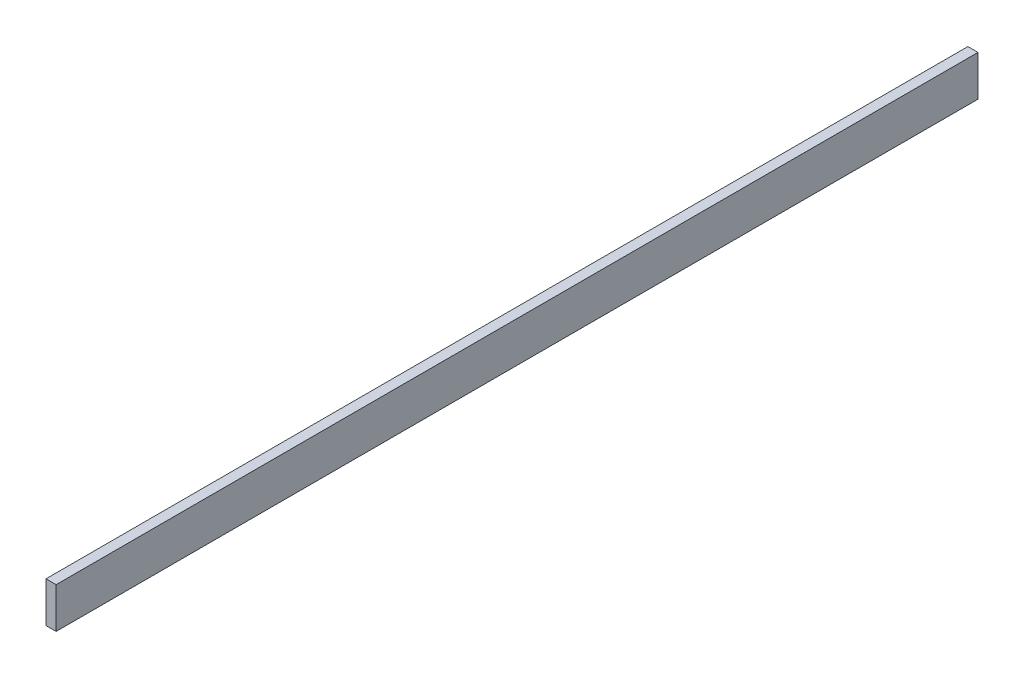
from build123d import *

# Parameters (mm, degrees)
SKETCH1_W           = 25.4
SKETCH1_H           = 101.6
BOSS_EXTRUDE1_DEPTH = 2311.4


with BuildPart() as part:
    # Sketch1 → Boss-Extrude1 (new body)
    with BuildSketch(Plane.XY):
        Rectangle(SKETCH1_W, SKETCH1_H)
    extrude(amount=BOSS_EXTRUDE1_DEPTH)


solid = part.part
